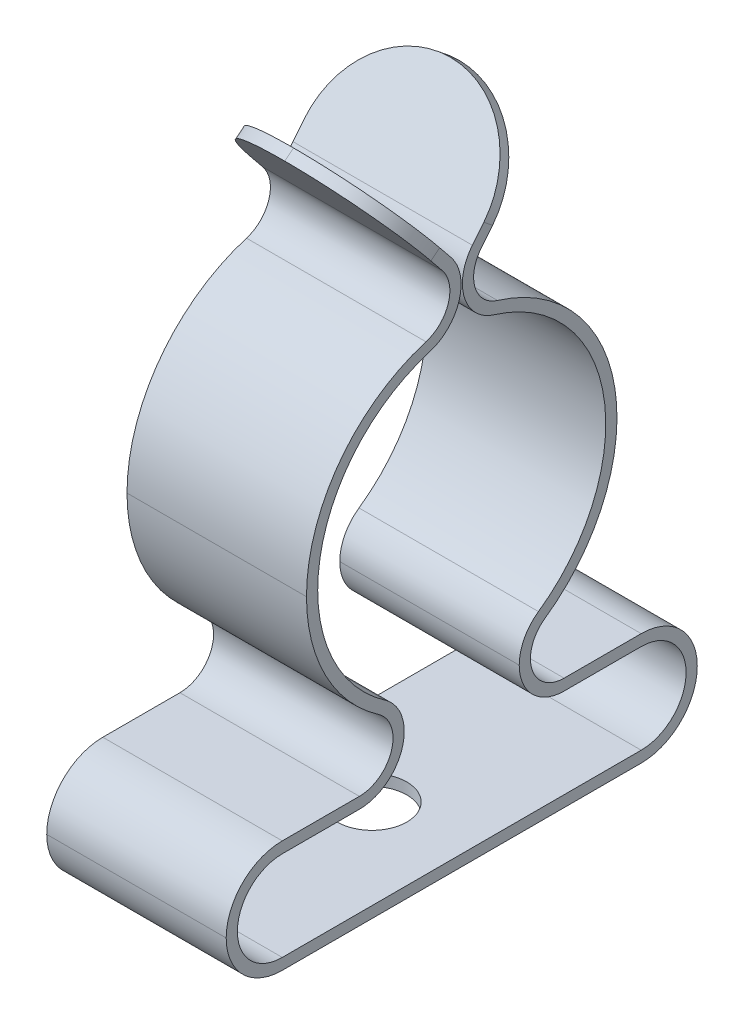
ISO-10303-21;
HEADER;
FILE_DESCRIPTION(('STEP AP214'),'2;1');
FILE_NAME('part.step','',(''),(''),'','','');
FILE_SCHEMA(('AUTOMOTIVE_DESIGN { 1 0 10303 214 1 1 1 1 }'));
ENDSEC;
DATA;
#1=APPLICATION_CONTEXT('core data for automotive mechanical design processes');
#2=APPLICATION_PROTOCOL_DEFINITION('international standard','automotive_design',2000,#1);
#3=PRODUCT_CONTEXT('',#1,'mechanical');
#4=PRODUCT('Part','Part','',(#3));
#5=PRODUCT_RELATED_PRODUCT_CATEGORY('part','',(#4));
#6=PRODUCT_DEFINITION_FORMATION('','',#4);
#7=PRODUCT_DEFINITION_CONTEXT('part definition',#1,'design');
#8=PRODUCT_DEFINITION('design','',#6,#7);
#9=PRODUCT_DEFINITION_SHAPE('','',#8);
#10=(LENGTH_UNIT() NAMED_UNIT(*) SI_UNIT(.MILLI.,.METRE.));
#11=(NAMED_UNIT(*) PLANE_ANGLE_UNIT() SI_UNIT($,.RADIAN.));
#12=(NAMED_UNIT(*) SI_UNIT($,.STERADIAN.) SOLID_ANGLE_UNIT());
#13=UNCERTAINTY_MEASURE_WITH_UNIT(LENGTH_MEASURE(1.E-05),#10,'distance_accuracy_value','');
#14=(GEOMETRIC_REPRESENTATION_CONTEXT(3) GLOBAL_UNCERTAINTY_ASSIGNED_CONTEXT((#13)) GLOBAL_UNIT_ASSIGNED_CONTEXT((#10,
#11,#12)) REPRESENTATION_CONTEXT('',''));
#15=CARTESIAN_POINT('',(0.,0.,0.));
#16=DIRECTION('',(0.,0.,1.));
#17=DIRECTION('',(1.,0.,0.));
#18=AXIS2_PLACEMENT_3D('',#15,#16,#17);
#19=CARTESIAN_POINT('',(0.,32.4320461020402,4.45967637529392));
#20=DIRECTION('',(0.,-0.628730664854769,-0.77762314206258));
#21=DIRECTION('',(0.,0.777623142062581,-0.628730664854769));
#22=AXIS2_PLACEMENT_3D('',#19,#20,#21);
#23=CYLINDRICAL_SURFACE('',#22,4.);
#24=CARTESIAN_POINT('',(0.,33.6895074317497,6.01492265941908));
#25=DIRECTION('',(0.,0.628730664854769,0.77762314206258));
#26=DIRECTION('',(0.,-0.77762314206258,0.628730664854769));
#27=AXIS2_PLACEMENT_3D('',#24,#25,#26);
#28=CIRCLE('',#27,4.);
#29=CARTESIAN_POINT('',(0.,36.8,3.5));
#30=VERTEX_POINT('',#29);
#31=CARTESIAN_POINT('',(-4.,33.6895074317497,6.01492265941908));
#32=VERTEX_POINT('',#31);
#33=EDGE_CURVE('E518',#30,#32,#28,.T.);
#34=ORIENTED_EDGE('',*,*,#33,.F.);
#35=DIRECTION('',(0.,-0.628730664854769,-0.777623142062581));
#36=VECTOR('',#35,1.);
#37=CARTESIAN_POINT('',(0.,36.4856346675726,3.11118842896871));
#38=LINE('',#37,#36);
#39=CARTESIAN_POINT('',(0.,36.4856346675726,3.11118842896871));
#40=VERTEX_POINT('',#39);
#41=EDGE_CURVE('E11',#30,#40,#38,.T.);
#42=ORIENTED_EDGE('',*,*,#41,.T.);
#43=CARTESIAN_POINT('',(0.,33.3751420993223,5.62611108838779));
#44=DIRECTION('',(0.,-0.628730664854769,-0.77762314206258));
#45=DIRECTION('',(0.,-0.77762314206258,0.628730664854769));
#46=AXIS2_PLACEMENT_3D('',#43,#44,#45);
#47=CIRCLE('',#46,4.);
#48=CARTESIAN_POINT('',(-4.,33.3751420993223,5.62611108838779));
#49=VERTEX_POINT('',#48);
#50=EDGE_CURVE('E493',#49,#40,#47,.T.);
#51=ORIENTED_EDGE('',*,*,#50,.F.);
#52=DIRECTION('',(0.,-0.628730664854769,-0.777623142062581));
#53=VECTOR('',#52,1.);
#54=CARTESIAN_POINT('',(-4.,32.4320461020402,4.45967637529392));
#55=LINE('',#54,#53);
#56=EDGE_CURVE('E281',#32,#49,#55,.T.);
#57=ORIENTED_EDGE('',*,*,#56,.F.);
#58=EDGE_LOOP('',(#34,#42,#51,#57));
#59=FACE_BOUND('',#58,.T.);
#60=ADVANCED_FACE('F16',(#59),#23,.T.);
#61=CARTESIAN_POINT('',(0.,33.6895074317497,6.01492265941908));
#62=DIRECTION('',(0.,0.628730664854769,0.77762314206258));
#63=DIRECTION('',(0.,-0.777623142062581,0.628730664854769));
#64=AXIS2_PLACEMENT_3D('',#61,#62,#63);
#65=CYLINDRICAL_SURFACE('',#64,4.);
#66=ORIENTED_EDGE('',*,*,#41,.F.);
#67=CARTESIAN_POINT('',(0.,33.6895074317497,6.01492265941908));
#68=DIRECTION('',(0.,0.628730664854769,0.77762314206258));
#69=DIRECTION('',(0.,-0.77762314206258,0.628730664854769));
#70=AXIS2_PLACEMENT_3D('',#67,#68,#69);
#71=CIRCLE('',#70,4.);
#72=CARTESIAN_POINT('',(4.,33.6895074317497,6.01492265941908));
#73=VERTEX_POINT('',#72);
#74=EDGE_CURVE('E511',#73,#30,#71,.T.);
#75=ORIENTED_EDGE('',*,*,#74,.F.);
#76=DIRECTION('',(0.,0.628730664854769,0.777623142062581));
#77=VECTOR('',#76,1.);
#78=CARTESIAN_POINT('',(4.,33.6895074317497,6.01492265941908));
#79=LINE('',#78,#77);
#80=CARTESIAN_POINT('',(4.,33.3751420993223,5.62611108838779));
#81=VERTEX_POINT('',#80);
#82=EDGE_CURVE('E275',#81,#73,#79,.T.);
#83=ORIENTED_EDGE('',*,*,#82,.F.);
#84=CARTESIAN_POINT('',(0.,33.3751420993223,5.62611108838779));
#85=DIRECTION('',(0.,-0.628730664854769,-0.77762314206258));
#86=DIRECTION('',(0.,-0.77762314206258,0.628730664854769));
#87=AXIS2_PLACEMENT_3D('',#84,#85,#86);
#88=CIRCLE('',#87,4.);
#89=EDGE_CURVE('E502',#40,#81,#88,.T.);
#90=ORIENTED_EDGE('',*,*,#89,.F.);
#91=EDGE_LOOP('',(#66,#75,#83,#90));
#92=FACE_BOUND('',#91,.T.);
#93=ADVANCED_FACE('F18',(#92),#65,.T.);
#94=CARTESIAN_POINT('',(0.,34.4163548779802,7.08610195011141));
#95=DIRECTION('',(0.,0.628730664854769,-0.77762314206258));
#96=DIRECTION('',(0.,0.777623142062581,0.628730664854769));
#97=AXIS2_PLACEMENT_3D('',#94,#95,#96);
#98=CYLINDRICAL_SURFACE('',#97,4.);
#99=CARTESIAN_POINT('',(0.,33.3751420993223,8.37388891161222));
#100=DIRECTION('',(0.,-0.628730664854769,0.77762314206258));
#101=DIRECTION('',(0.,0.77762314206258,0.628730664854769));
#102=AXIS2_PLACEMENT_3D('',#99,#100,#101);
#103=CIRCLE('',#102,4.);
#104=CARTESIAN_POINT('',(0.,36.4856346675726,10.8888115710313));
#105=VERTEX_POINT('',#104);
#106=CARTESIAN_POINT('',(-4.,33.3751420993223,8.37388891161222));
#107=VERTEX_POINT('',#106);
#108=EDGE_CURVE('E372',#105,#107,#103,.T.);
#109=ORIENTED_EDGE('',*,*,#108,.F.);
#110=DIRECTION('',(0.,0.628730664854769,-0.777623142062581));
#111=VECTOR('',#110,1.);
#112=CARTESIAN_POINT('',(0.,36.8,10.5));
#113=LINE('',#112,#111);
#114=CARTESIAN_POINT('',(0.,36.8,10.5));
#115=VERTEX_POINT('',#114);
#116=EDGE_CURVE('E25',#105,#115,#113,.T.);
#117=ORIENTED_EDGE('',*,*,#116,.T.);
#118=CARTESIAN_POINT('',(0.,33.6895074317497,7.98507734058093));
#119=DIRECTION('',(0.,0.628730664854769,-0.77762314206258));
#120=DIRECTION('',(0.,0.77762314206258,0.628730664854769));
#121=AXIS2_PLACEMENT_3D('',#118,#119,#120);
#122=CIRCLE('',#121,4.);
#123=CARTESIAN_POINT('',(-4.,33.6895074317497,7.98507734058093));
#124=VERTEX_POINT('',#123);
#125=EDGE_CURVE('E438',#124,#115,#122,.T.);
#126=ORIENTED_EDGE('',*,*,#125,.F.);
#127=DIRECTION('',(0.,0.628730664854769,-0.777623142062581));
#128=VECTOR('',#127,1.);
#129=CARTESIAN_POINT('',(-4.,34.4163548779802,7.08610195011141));
#130=LINE('',#129,#128);
#131=EDGE_CURVE('E279',#107,#124,#130,.T.);
#132=ORIENTED_EDGE('',*,*,#131,.F.);
#133=EDGE_LOOP('',(#109,#117,#126,#132));
#134=FACE_BOUND('',#133,.T.);
#135=ADVANCED_FACE('F881',(#134),#98,.T.);
#136=CARTESIAN_POINT('',(0.,33.3751420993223,8.37388891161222));
#137=DIRECTION('',(0.,-0.628730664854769,0.77762314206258));
#138=DIRECTION('',(0.,-0.777623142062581,-0.628730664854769));
#139=AXIS2_PLACEMENT_3D('',#136,#137,#138);
#140=CYLINDRICAL_SURFACE('',#139,4.);
#141=ORIENTED_EDGE('',*,*,#116,.F.);
#142=CARTESIAN_POINT('',(0.,33.3751420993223,8.37388891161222));
#143=DIRECTION('',(0.,-0.628730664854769,0.77762314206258));
#144=DIRECTION('',(0.,0.77762314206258,0.628730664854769));
#145=AXIS2_PLACEMENT_3D('',#142,#143,#144);
#146=CIRCLE('',#145,4.);
#147=CARTESIAN_POINT('',(4.,33.3751420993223,8.37388891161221));
#148=VERTEX_POINT('',#147);
#149=EDGE_CURVE('E368',#148,#105,#146,.T.);
#150=ORIENTED_EDGE('',*,*,#149,.F.);
#151=DIRECTION('',(0.,-0.628730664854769,0.777623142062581));
#152=VECTOR('',#151,1.);
#153=CARTESIAN_POINT('',(4.,33.3751420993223,8.37388891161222));
#154=LINE('',#153,#152);
#155=CARTESIAN_POINT('',(4.,33.6895074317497,7.98507734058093));
#156=VERTEX_POINT('',#155);
#157=EDGE_CURVE('E272',#156,#148,#154,.T.);
#158=ORIENTED_EDGE('',*,*,#157,.F.);
#159=CARTESIAN_POINT('',(0.,33.6895074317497,7.98507734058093));
#160=DIRECTION('',(0.,0.628730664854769,-0.77762314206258));
#161=DIRECTION('',(0.,0.77762314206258,0.628730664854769));
#162=AXIS2_PLACEMENT_3D('',#159,#160,#161);
#163=CIRCLE('',#162,4.);
#164=EDGE_CURVE('E442',#115,#156,#163,.T.);
#165=ORIENTED_EDGE('',*,*,#164,.F.);
#166=EDGE_LOOP('',(#141,#150,#158,#165));
#167=FACE_BOUND('',#166,.T.);
#168=ADVANCED_FACE('F891',(#167),#140,.T.);
#169=CARTESIAN_POINT('',(0.,14.1840620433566,7.));
#170=DIRECTION('',(0.,-1.,0.));
#171=DIRECTION('',(-1.,0.,0.));
#172=AXIS2_PLACEMENT_3D('',#169,#170,#171);
#173=CYLINDRICAL_SURFACE('',#172,1.55);
#174=DIRECTION('',(0.,-1.,0.));
#175=VECTOR('',#174,1.);
#176=CARTESIAN_POINT('',(1.55000000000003,14.1840620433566,7.));
#177=LINE('',#176,#175);
#178=CARTESIAN_POINT('',(1.55000000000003,9.8,7.));
#179=VERTEX_POINT('',#178);
#180=CARTESIAN_POINT('',(1.55000000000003,9.3,7.));
#181=VERTEX_POINT('',#180);
#182=EDGE_CURVE('E766',#179,#181,#177,.T.);
#183=ORIENTED_EDGE('',*,*,#182,.F.);
#184=CARTESIAN_POINT('',(0.,9.8,7.));
#185=DIRECTION('',(0.,-1.,0.));
#186=DIRECTION('',(1.,0.,0.));
#187=AXIS2_PLACEMENT_3D('',#184,#185,#186);
#188=CIRCLE('',#187,1.55);
#189=CARTESIAN_POINT('',(-1.54999999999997,9.8,7.));
#190=VERTEX_POINT('',#189);
#191=EDGE_CURVE('E307',#190,#179,#188,.T.);
#192=ORIENTED_EDGE('',*,*,#191,.F.);
#193=DIRECTION('',(0.,-1.,0.));
#194=VECTOR('',#193,1.);
#195=CARTESIAN_POINT('',(-1.54999999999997,14.1840620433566,7.));
#196=LINE('',#195,#194);
#197=CARTESIAN_POINT('',(-1.54999999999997,9.3,7.));
#198=VERTEX_POINT('',#197);
#199=EDGE_CURVE('E301',#190,#198,#196,.T.);
#200=ORIENTED_EDGE('',*,*,#199,.T.);
#201=CARTESIAN_POINT('',(0.,9.3,7.));
#202=DIRECTION('',(0.,-1.,0.));
#203=DIRECTION('',(-1.,0.,0.));
#204=AXIS2_PLACEMENT_3D('',#201,#202,#203);
#205=CIRCLE('',#204,1.55);
#206=EDGE_CURVE('E659',#198,#181,#205,.T.);
#207=ORIENTED_EDGE('',*,*,#206,.T.);
#208=EDGE_LOOP('',(#183,#192,#200,#207));
#209=FACE_BOUND('',#208,.T.);
#210=ADVANCED_FACE('F899',(#209),#173,.F.);
#211=CARTESIAN_POINT('',(-4.,31.8,4.97070381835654));
#212=DIRECTION('',(-1.,0.,0.));
#213=DIRECTION('',(0.,-1.,0.));
#214=AXIS2_PLACEMENT_3D('',#211,#212,#213);
#215=PLANE('',#214);
#216=DIRECTION('',(0.,-0.77762314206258,-0.62873066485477));
#217=VECTOR('',#216,1.);
#218=CARTESIAN_POINT('',(-4.,32.7430959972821,7.86286146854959));
#219=LINE('',#218,#217);
#220=CARTESIAN_POINT('',(-4.,32.7430959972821,7.86286146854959));
#221=VERTEX_POINT('',#220);
#222=EDGE_CURVE('E613',#107,#221,#219,.T.);
#223=ORIENTED_EDGE('',*,*,#222,.F.);
#224=ORIENTED_EDGE('',*,*,#131,.T.);
#225=DIRECTION('',(0.,-0.77762314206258,-0.628730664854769));
#226=VECTOR('',#225,1.);
#227=CARTESIAN_POINT('',(-4.,33.0574613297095,7.4740498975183));
#228=LINE('',#227,#226);
#229=CARTESIAN_POINT('',(-4.,33.0574613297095,7.4740498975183));
#230=VERTEX_POINT('',#229);
#231=EDGE_CURVE('E443',#124,#230,#228,.T.);
#232=ORIENTED_EDGE('',*,*,#231,.T.);
#233=CARTESIAN_POINT('',(-4.,31.8,9.02929618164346));
#234=DIRECTION('',(-1.,0.,0.));
#235=DIRECTION('',(0.,0.,-1.));
#236=AXIS2_PLACEMENT_3D('',#233,#234,#235);
#237=CIRCLE('',#236,2.);
#238=CARTESIAN_POINT('',(-4.,29.88586463,8.44956711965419));
#239=VERTEX_POINT('',#238);
#240=EDGE_CURVE('E597',#230,#239,#237,.T.);
#241=ORIENTED_EDGE('',*,*,#240,.T.);
#242=CARTESIAN_POINT('',(-4.,23.186390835,6.42051540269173));
#243=DIRECTION('',(1.,0.,0.));
#244=DIRECTION('',(0.,0.,1.));
#245=AXIS2_PLACEMENT_3D('',#242,#243,#244);
#246=CIRCLE('',#245,7.);
#247=CARTESIAN_POINT('',(-4.,23.186390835,13.4205154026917));
#248=VERTEX_POINT('',#247);
#249=EDGE_CURVE('E413',#239,#248,#246,.T.);
#250=ORIENTED_EDGE('',*,*,#249,.T.);
#251=CARTESIAN_POINT('',(-4.,23.186390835,6.42051540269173));
#252=DIRECTION('',(1.,0.,0.));
#253=DIRECTION('',(0.,0.,1.));
#254=AXIS2_PLACEMENT_3D('',#251,#252,#253);
#255=CIRCLE('',#254,7.);
#256=CARTESIAN_POINT('',(-4.,17.4414201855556,10.419929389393));
#257=VERTEX_POINT('',#256);
#258=EDGE_CURVE('E514',#248,#257,#255,.T.);
#259=ORIENTED_EDGE('',*,*,#258,.T.);
#260=CARTESIAN_POINT('',(-4.,15.8,11.5626190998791));
#261=DIRECTION('',(-1.,0.,0.));
#262=DIRECTION('',(0.,0.,-1.));
#263=AXIS2_PLACEMENT_3D('',#260,#261,#262);
#264=CIRCLE('',#263,2.);
#265=CARTESIAN_POINT('',(-4.,13.8,11.5626190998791));
#266=VERTEX_POINT('',#265);
#267=EDGE_CURVE('E494',#257,#266,#264,.T.);
#268=ORIENTED_EDGE('',*,*,#267,.T.);
#269=DIRECTION('',(0.,0.,1.));
#270=VECTOR('',#269,1.);
#271=CARTESIAN_POINT('',(-4.,13.8,15.));
#272=LINE('',#271,#270);
#273=CARTESIAN_POINT('',(-4.,13.8,15.));
#274=VERTEX_POINT('',#273);
#275=EDGE_CURVE('E337',#266,#274,#272,.T.);
#276=ORIENTED_EDGE('',*,*,#275,.T.);
#277=CARTESIAN_POINT('',(-4.,11.8,15.));
#278=DIRECTION('',(1.,0.,0.));
#279=DIRECTION('',(0.,0.,1.));
#280=AXIS2_PLACEMENT_3D('',#277,#278,#279);
#281=CIRCLE('',#280,2.);
#282=CARTESIAN_POINT('',(-4.,11.8,17.));
#283=VERTEX_POINT('',#282);
#284=EDGE_CURVE('E435',#274,#283,#281,.T.);
#285=ORIENTED_EDGE('',*,*,#284,.T.);
#286=CARTESIAN_POINT('',(-4.,11.8,15.));
#287=DIRECTION('',(1.,0.,0.));
#288=DIRECTION('',(0.,0.,1.));
#289=AXIS2_PLACEMENT_3D('',#286,#287,#288);
#290=CIRCLE('',#289,2.);
#291=CARTESIAN_POINT('',(-4.,9.8,15.));
#292=VERTEX_POINT('',#291);
#293=EDGE_CURVE('E306',#283,#292,#290,.T.);
#294=ORIENTED_EDGE('',*,*,#293,.T.);
#295=DIRECTION('',(0.,0.,-1.));
#296=VECTOR('',#295,1.);
#297=CARTESIAN_POINT('',(-4.,9.8,15.));
#298=LINE('',#297,#296);
#299=CARTESIAN_POINT('',(-4.,9.8,-1.));
#300=VERTEX_POINT('',#299);
#301=EDGE_CURVE('E573',#292,#300,#298,.T.);
#302=ORIENTED_EDGE('',*,*,#301,.T.);
#303=CARTESIAN_POINT('',(-4.,11.8,-1.));
#304=DIRECTION('',(1.,0.,0.));
#305=DIRECTION('',(0.,0.,-1.));
#306=AXIS2_PLACEMENT_3D('',#303,#304,#305);
#307=CIRCLE('',#306,2.);
#308=CARTESIAN_POINT('',(-4.,13.8,-1.));
#309=VERTEX_POINT('',#308);
#310=EDGE_CURVE('E563',#300,#309,#307,.T.);
#311=ORIENTED_EDGE('',*,*,#310,.T.);
#312=DIRECTION('',(0.,0.,1.));
#313=VECTOR('',#312,1.);
#314=CARTESIAN_POINT('',(-4.,13.8,-1.));
#315=LINE('',#314,#313);
#316=CARTESIAN_POINT('',(-4.,13.8,2.43738090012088));
#317=VERTEX_POINT('',#316);
#318=EDGE_CURVE('E552',#309,#317,#315,.T.);
#319=ORIENTED_EDGE('',*,*,#318,.T.);
#320=CARTESIAN_POINT('',(-4.,15.8,2.43738090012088));
#321=DIRECTION('',(-1.,0.,0.));
#322=DIRECTION('',(0.,0.,1.));
#323=AXIS2_PLACEMENT_3D('',#320,#321,#322);
#324=CIRCLE('',#323,2.);
#325=CARTESIAN_POINT('',(-4.,15.8,4.43738090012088));
#326=VERTEX_POINT('',#325);
#327=EDGE_CURVE('E456',#317,#326,#324,.T.);
#328=ORIENTED_EDGE('',*,*,#327,.T.);
#329=CARTESIAN_POINT('',(-4.,15.8,2.43738090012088));
#330=DIRECTION('',(-1.,0.,0.));
#331=DIRECTION('',(0.,0.,1.));
#332=AXIS2_PLACEMENT_3D('',#329,#330,#331);
#333=CIRCLE('',#332,2.);
#334=CARTESIAN_POINT('',(-4.,17.4414201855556,3.58007061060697));
#335=VERTEX_POINT('',#334);
#336=EDGE_CURVE('E548',#326,#335,#333,.T.);
#337=ORIENTED_EDGE('',*,*,#336,.T.);
#338=CARTESIAN_POINT('',(-4.,23.186390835,7.57948459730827));
#339=DIRECTION('',(1.,0.,0.));
#340=DIRECTION('',(0.,0.,-1.));
#341=AXIS2_PLACEMENT_3D('',#338,#339,#340);
#342=CIRCLE('',#341,7.);
#343=CARTESIAN_POINT('',(-4.,29.88586463,5.55043288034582));
#344=VERTEX_POINT('',#343);
#345=EDGE_CURVE('E382',#335,#344,#342,.T.);
#346=ORIENTED_EDGE('',*,*,#345,.T.);
#347=CARTESIAN_POINT('',(-4.,31.8,4.97070381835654));
#348=DIRECTION('',(-1.,0.,0.));
#349=DIRECTION('',(0.,0.,1.));
#350=AXIS2_PLACEMENT_3D('',#347,#348,#349);
#351=CIRCLE('',#350,2.);
#352=CARTESIAN_POINT('',(-4.,31.8,6.97070381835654));
#353=VERTEX_POINT('',#352);
#354=EDGE_CURVE('E468',#344,#353,#351,.T.);
#355=ORIENTED_EDGE('',*,*,#354,.T.);
#356=CARTESIAN_POINT('',(-4.,31.8,4.97070381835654));
#357=DIRECTION('',(-1.,0.,0.));
#358=DIRECTION('',(0.,0.,1.));
#359=AXIS2_PLACEMENT_3D('',#356,#357,#358);
#360=CIRCLE('',#359,2.);
#361=CARTESIAN_POINT('',(-4.,33.0574613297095,6.5259501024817));
#362=VERTEX_POINT('',#361);
#363=EDGE_CURVE('E387',#353,#362,#360,.T.);
#364=ORIENTED_EDGE('',*,*,#363,.T.);
#365=DIRECTION('',(0.,0.77762314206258,-0.628730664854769));
#366=VECTOR('',#365,1.);
#367=CARTESIAN_POINT('',(-4.,33.0574613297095,6.5259501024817));
#368=LINE('',#367,#366);
#369=EDGE_CURVE('E522',#362,#32,#368,.T.);
#370=ORIENTED_EDGE('',*,*,#369,.T.);
#371=ORIENTED_EDGE('',*,*,#56,.T.);
#372=DIRECTION('',(0.,0.77762314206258,-0.62873066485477));
#373=VECTOR('',#372,1.);
#374=CARTESIAN_POINT('',(-4.,32.7430959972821,6.13713853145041));
#375=LINE('',#374,#373);
#376=CARTESIAN_POINT('',(-4.,32.7430959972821,6.13713853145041));
#377=VERTEX_POINT('',#376);
#378=EDGE_CURVE('E489',#377,#49,#375,.T.);
#379=ORIENTED_EDGE('',*,*,#378,.F.);
#380=CARTESIAN_POINT('',(-4.,31.8,4.97070381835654));
#381=DIRECTION('',(-1.,0.,0.));
#382=DIRECTION('',(0.,0.,-1.));
#383=AXIS2_PLACEMENT_3D('',#380,#381,#382);
#384=CIRCLE('',#383,1.5);
#385=CARTESIAN_POINT('',(-4.,31.8,6.47070381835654));
#386=VERTEX_POINT('',#385);
#387=EDGE_CURVE('E326',#386,#377,#384,.T.);
#388=ORIENTED_EDGE('',*,*,#387,.F.);
#389=CARTESIAN_POINT('',(-4.,31.8,4.97070381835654));
#390=DIRECTION('',(-1.,0.,0.));
#391=DIRECTION('',(0.,0.,-1.));
#392=AXIS2_PLACEMENT_3D('',#389,#390,#391);
#393=CIRCLE('',#392,1.5);
#394=CARTESIAN_POINT('',(-4.,30.3643984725,5.4055006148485));
#395=VERTEX_POINT('',#394);
#396=EDGE_CURVE('E49',#395,#386,#393,.T.);
#397=ORIENTED_EDGE('',*,*,#396,.F.);
#398=CARTESIAN_POINT('',(-4.,23.186390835,7.57948459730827));
#399=DIRECTION('',(1.,0.,0.));
#400=DIRECTION('',(0.,0.,-1.));
#401=AXIS2_PLACEMENT_3D('',#398,#399,#400);
#402=CIRCLE('',#401,7.5);
#403=CARTESIAN_POINT('',(-4.,17.0310651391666,3.29439818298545));
#404=VERTEX_POINT('',#403);
#405=EDGE_CURVE('E243',#404,#395,#402,.T.);
#406=ORIENTED_EDGE('',*,*,#405,.F.);
#407=CARTESIAN_POINT('',(-4.,15.8,2.43738090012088));
#408=DIRECTION('',(-1.,0.,0.));
#409=DIRECTION('',(0.,0.,-1.));
#410=AXIS2_PLACEMENT_3D('',#407,#408,#409);
#411=CIRCLE('',#410,1.5);
#412=CARTESIAN_POINT('',(-4.,15.8,3.93738090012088));
#413=VERTEX_POINT('',#412);
#414=EDGE_CURVE('E238',#413,#404,#411,.T.);
#415=ORIENTED_EDGE('',*,*,#414,.F.);
#416=CARTESIAN_POINT('',(-4.,15.8,2.43738090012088));
#417=DIRECTION('',(-1.,0.,0.));
#418=DIRECTION('',(0.,0.,-1.));
#419=AXIS2_PLACEMENT_3D('',#416,#417,#418);
#420=CIRCLE('',#419,1.5);
#421=CARTESIAN_POINT('',(-4.,14.3,2.43738090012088));
#422=VERTEX_POINT('',#421);
#423=EDGE_CURVE('E229',#422,#413,#420,.T.);
#424=ORIENTED_EDGE('',*,*,#423,.F.);
#425=DIRECTION('',(0.,0.,1.));
#426=VECTOR('',#425,1.);
#427=CARTESIAN_POINT('',(-4.,14.3,-1.));
#428=LINE('',#427,#426);
#429=CARTESIAN_POINT('',(-4.,14.3,-1.));
#430=VERTEX_POINT('',#429);
#431=EDGE_CURVE('E234',#430,#422,#428,.T.);
#432=ORIENTED_EDGE('',*,*,#431,.F.);
#433=CARTESIAN_POINT('',(-4.,11.8,-1.));
#434=DIRECTION('',(1.,0.,0.));
#435=DIRECTION('',(0.,0.,-1.));
#436=AXIS2_PLACEMENT_3D('',#433,#434,#435);
#437=CIRCLE('',#436,2.5);
#438=CARTESIAN_POINT('',(-4.,9.3,-1.));
#439=VERTEX_POINT('',#438);
#440=EDGE_CURVE('E662',#439,#430,#437,.T.);
#441=ORIENTED_EDGE('',*,*,#440,.F.);
#442=DIRECTION('',(0.,0.,-1.));
#443=VECTOR('',#442,1.);
#444=CARTESIAN_POINT('',(-4.,9.3,15.));
#445=LINE('',#444,#443);
#446=CARTESIAN_POINT('',(-4.,9.3,15.));
#447=VERTEX_POINT('',#446);
#448=EDGE_CURVE('E647',#447,#439,#445,.T.);
#449=ORIENTED_EDGE('',*,*,#448,.F.);
#450=CARTESIAN_POINT('',(-4.,11.8,15.));
#451=DIRECTION('',(1.,0.,0.));
#452=DIRECTION('',(0.,0.,-1.));
#453=AXIS2_PLACEMENT_3D('',#450,#451,#452);
#454=CIRCLE('',#453,2.5);
#455=CARTESIAN_POINT('',(-4.,11.8,17.5));
#456=VERTEX_POINT('',#455);
#457=EDGE_CURVE('E333',#456,#447,#454,.T.);
#458=ORIENTED_EDGE('',*,*,#457,.F.);
#459=CARTESIAN_POINT('',(-4.,11.8,15.));
#460=DIRECTION('',(1.,0.,0.));
#461=DIRECTION('',(0.,0.,-1.));
#462=AXIS2_PLACEMENT_3D('',#459,#460,#461);
#463=CIRCLE('',#462,2.5);
#464=CARTESIAN_POINT('',(-4.,14.3,15.));
#465=VERTEX_POINT('',#464);
#466=EDGE_CURVE('E461',#465,#456,#463,.T.);
#467=ORIENTED_EDGE('',*,*,#466,.F.);
#468=DIRECTION('',(0.,0.,1.));
#469=VECTOR('',#468,1.);
#470=CARTESIAN_POINT('',(-4.,14.3,15.));
#471=LINE('',#470,#469);
#472=CARTESIAN_POINT('',(-4.,14.3,11.5626190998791));
#473=VERTEX_POINT('',#472);
#474=EDGE_CURVE('E427',#473,#465,#471,.T.);
#475=ORIENTED_EDGE('',*,*,#474,.F.);
#476=CARTESIAN_POINT('',(-4.,15.8,11.5626190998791));
#477=DIRECTION('',(-1.,0.,0.));
#478=DIRECTION('',(0.,0.,-1.));
#479=AXIS2_PLACEMENT_3D('',#476,#477,#478);
#480=CIRCLE('',#479,1.5);
#481=CARTESIAN_POINT('',(-4.,17.0310651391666,10.7056018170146));
#482=VERTEX_POINT('',#481);
#483=EDGE_CURVE('E474',#482,#473,#480,.T.);
#484=ORIENTED_EDGE('',*,*,#483,.F.);
#485=CARTESIAN_POINT('',(-4.,23.186390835,6.42051540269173));
#486=DIRECTION('',(1.,0.,0.));
#487=DIRECTION('',(0.,0.,-1.));
#488=AXIS2_PLACEMENT_3D('',#485,#486,#487);
#489=CIRCLE('',#488,7.5);
#490=CARTESIAN_POINT('',(-4.,23.186390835,13.9205154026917));
#491=VERTEX_POINT('',#490);
#492=EDGE_CURVE('E381',#491,#482,#489,.T.);
#493=ORIENTED_EDGE('',*,*,#492,.F.);
#494=CARTESIAN_POINT('',(-4.,23.186390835,6.42051540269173));
#495=DIRECTION('',(1.,0.,0.));
#496=DIRECTION('',(0.,0.,-1.));
#497=AXIS2_PLACEMENT_3D('',#494,#495,#496);
#498=CIRCLE('',#497,7.5);
#499=CARTESIAN_POINT('',(-4.,30.3643984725,8.59449938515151));
#500=VERTEX_POINT('',#499);
#501=EDGE_CURVE('E637',#500,#491,#498,.T.);
#502=ORIENTED_EDGE('',*,*,#501,.F.);
#503=CARTESIAN_POINT('',(-4.,31.8,9.02929618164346));
#504=DIRECTION('',(-1.,0.,0.));
#505=DIRECTION('',(0.,0.,-1.));
#506=AXIS2_PLACEMENT_3D('',#503,#504,#505);
#507=CIRCLE('',#506,1.5);
#508=EDGE_CURVE('E408',#221,#500,#507,.T.);
#509=ORIENTED_EDGE('',*,*,#508,.F.);
#510=EDGE_LOOP('',(#223,#224,#232,#241,#250,#259,#268,#276,#285,#294,#302,#311,#319,#328,#337,
#346,#355,#364,#370,#371,#379,#388,#397,#406,#415,#424,#432,#441,#449,#458,#467,#475,#484,#493,
#502,#509));
#511=FACE_BOUND('',#510,.T.);
#512=ADVANCED_FACE('F232',(#511),#215,.T.);
#513=CARTESIAN_POINT('',(4.,31.8,4.97070381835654));
#514=DIRECTION('',(-1.,0.,0.));
#515=DIRECTION('',(0.,-1.,0.));
#516=AXIS2_PLACEMENT_3D('',#513,#514,#515);
#517=PLANE('',#516);
#518=DIRECTION('',(0.,-0.77762314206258,-0.628730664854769));
#519=VECTOR('',#518,1.);
#520=CARTESIAN_POINT('',(4.,33.0574613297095,7.4740498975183));
#521=LINE('',#520,#519);
#522=CARTESIAN_POINT('',(4.,33.0574613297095,7.4740498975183));
#523=VERTEX_POINT('',#522);
#524=EDGE_CURVE('E373',#156,#523,#521,.T.);
#525=ORIENTED_EDGE('',*,*,#524,.F.);
#526=ORIENTED_EDGE('',*,*,#157,.T.);
#527=DIRECTION('',(0.,-0.77762314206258,-0.62873066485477));
#528=VECTOR('',#527,1.);
#529=CARTESIAN_POINT('',(4.,32.7430959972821,7.86286146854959));
#530=LINE('',#529,#528);
#531=CARTESIAN_POINT('',(4.,32.7430959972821,7.86286146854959));
#532=VERTEX_POINT('',#531);
#533=EDGE_CURVE('E404',#148,#532,#530,.T.);
#534=ORIENTED_EDGE('',*,*,#533,.T.);
#535=CARTESIAN_POINT('',(4.,31.8,9.02929618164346));
#536=DIRECTION('',(-1.,0.,0.));
#537=DIRECTION('',(0.,0.,-1.));
#538=AXIS2_PLACEMENT_3D('',#535,#536,#537);
#539=CIRCLE('',#538,1.5);
#540=CARTESIAN_POINT('',(4.,30.3643984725,8.59449938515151));
#541=VERTEX_POINT('',#540);
#542=EDGE_CURVE('E629',#532,#541,#539,.T.);
#543=ORIENTED_EDGE('',*,*,#542,.T.);
#544=CARTESIAN_POINT('',(4.,23.186390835,6.42051540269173));
#545=DIRECTION('',(1.,0.,0.));
#546=DIRECTION('',(0.,0.,-1.));
#547=AXIS2_PLACEMENT_3D('',#544,#545,#546);
#548=CIRCLE('',#547,7.5);
#549=CARTESIAN_POINT('',(4.,23.186390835,13.9205154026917));
#550=VERTEX_POINT('',#549);
#551=EDGE_CURVE('E633',#541,#550,#548,.T.);
#552=ORIENTED_EDGE('',*,*,#551,.T.);
#553=CARTESIAN_POINT('',(4.,23.186390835,6.42051540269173));
#554=DIRECTION('',(1.,0.,0.));
#555=DIRECTION('',(0.,0.,-1.));
#556=AXIS2_PLACEMENT_3D('',#553,#554,#555);
#557=CIRCLE('',#556,7.5);
#558=CARTESIAN_POINT('',(4.,17.0310651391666,10.7056018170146));
#559=VERTEX_POINT('',#558);
#560=EDGE_CURVE('E364',#550,#559,#557,.T.);
#561=ORIENTED_EDGE('',*,*,#560,.T.);
#562=CARTESIAN_POINT('',(4.,15.8,11.5626190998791));
#563=DIRECTION('',(-1.,0.,0.));
#564=DIRECTION('',(0.,0.,-1.));
#565=AXIS2_PLACEMENT_3D('',#562,#563,#564);
#566=CIRCLE('',#565,1.5);
#567=CARTESIAN_POINT('',(4.,14.3,11.5626190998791));
#568=VERTEX_POINT('',#567);
#569=EDGE_CURVE('E473',#559,#568,#566,.T.);
#570=ORIENTED_EDGE('',*,*,#569,.T.);
#571=DIRECTION('',(0.,0.,1.));
#572=VECTOR('',#571,1.);
#573=CARTESIAN_POINT('',(4.,14.3,15.));
#574=LINE('',#573,#572);
#575=CARTESIAN_POINT('',(4.,14.3,15.));
#576=VERTEX_POINT('',#575);
#577=EDGE_CURVE('E426',#568,#576,#574,.T.);
#578=ORIENTED_EDGE('',*,*,#577,.T.);
#579=CARTESIAN_POINT('',(4.,11.8,15.));
#580=DIRECTION('',(1.,0.,0.));
#581=DIRECTION('',(0.,0.,-1.));
#582=AXIS2_PLACEMENT_3D('',#579,#580,#581);
#583=CIRCLE('',#582,2.5);
#584=CARTESIAN_POINT('',(4.,11.8,17.5));
#585=VERTEX_POINT('',#584);
#586=EDGE_CURVE('E457',#576,#585,#583,.T.);
#587=ORIENTED_EDGE('',*,*,#586,.T.);
#588=CARTESIAN_POINT('',(4.,11.8,15.));
#589=DIRECTION('',(1.,0.,0.));
#590=DIRECTION('',(0.,0.,-1.));
#591=AXIS2_PLACEMENT_3D('',#588,#589,#590);
#592=CIRCLE('',#591,2.5);
#593=CARTESIAN_POINT('',(4.,9.3,15.));
#594=VERTEX_POINT('',#593);
#595=EDGE_CURVE('E334',#585,#594,#592,.T.);
#596=ORIENTED_EDGE('',*,*,#595,.T.);
#597=DIRECTION('',(0.,0.,-1.));
#598=VECTOR('',#597,1.);
#599=CARTESIAN_POINT('',(4.,9.3,15.));
#600=LINE('',#599,#598);
#601=CARTESIAN_POINT('',(4.,9.3,-1.));
#602=VERTEX_POINT('',#601);
#603=EDGE_CURVE('E655',#594,#602,#600,.T.);
#604=ORIENTED_EDGE('',*,*,#603,.T.);
#605=CARTESIAN_POINT('',(4.,11.8,-1.));
#606=DIRECTION('',(1.,0.,0.));
#607=DIRECTION('',(0.,0.,-1.));
#608=AXIS2_PLACEMENT_3D('',#605,#606,#607);
#609=CIRCLE('',#608,2.5);
#610=CARTESIAN_POINT('',(4.,14.3,-1.));
#611=VERTEX_POINT('',#610);
#612=EDGE_CURVE('E260',#602,#611,#609,.T.);
#613=ORIENTED_EDGE('',*,*,#612,.T.);
#614=DIRECTION('',(0.,0.,1.));
#615=VECTOR('',#614,1.);
#616=CARTESIAN_POINT('',(4.,14.3,-1.));
#617=LINE('',#616,#615);
#618=CARTESIAN_POINT('',(4.,14.3,2.43738090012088));
#619=VERTEX_POINT('',#618);
#620=EDGE_CURVE('E253',#611,#619,#617,.T.);
#621=ORIENTED_EDGE('',*,*,#620,.T.);
#622=CARTESIAN_POINT('',(4.,15.8,2.43738090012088));
#623=DIRECTION('',(-1.,0.,0.));
#624=DIRECTION('',(0.,0.,-1.));
#625=AXIS2_PLACEMENT_3D('',#622,#623,#624);
#626=CIRCLE('',#625,1.5);
#627=CARTESIAN_POINT('',(4.,15.8,3.93738090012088));
#628=VERTEX_POINT('',#627);
#629=EDGE_CURVE('E244',#619,#628,#626,.T.);
#630=ORIENTED_EDGE('',*,*,#629,.T.);
#631=CARTESIAN_POINT('',(4.,15.8,2.43738090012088));
#632=DIRECTION('',(-1.,0.,0.));
#633=DIRECTION('',(0.,0.,-1.));
#634=AXIS2_PLACEMENT_3D('',#631,#632,#633);
#635=CIRCLE('',#634,1.5);
#636=CARTESIAN_POINT('',(4.,17.0310651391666,3.29439818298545));
#637=VERTEX_POINT('',#636);
#638=EDGE_CURVE('E345',#628,#637,#635,.T.);
#639=ORIENTED_EDGE('',*,*,#638,.T.);
#640=CARTESIAN_POINT('',(4.,23.186390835,7.57948459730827));
#641=DIRECTION('',(1.,0.,0.));
#642=DIRECTION('',(0.,0.,-1.));
#643=AXIS2_PLACEMENT_3D('',#640,#641,#642);
#644=CIRCLE('',#643,7.5);
#645=CARTESIAN_POINT('',(4.,30.3643984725,5.4055006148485));
#646=VERTEX_POINT('',#645);
#647=EDGE_CURVE('E313',#637,#646,#644,.T.);
#648=ORIENTED_EDGE('',*,*,#647,.T.);
#649=CARTESIAN_POINT('',(4.,31.8,4.97070381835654));
#650=DIRECTION('',(-1.,0.,0.));
#651=DIRECTION('',(0.,0.,-1.));
#652=AXIS2_PLACEMENT_3D('',#649,#650,#651);
#653=CIRCLE('',#652,1.5);
#654=CARTESIAN_POINT('',(4.,31.8,6.47070381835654));
#655=VERTEX_POINT('',#654);
#656=EDGE_CURVE('E36',#646,#655,#653,.T.);
#657=ORIENTED_EDGE('',*,*,#656,.T.);
#658=CARTESIAN_POINT('',(4.,31.8,4.97070381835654));
#659=DIRECTION('',(-1.,0.,0.));
#660=DIRECTION('',(0.,0.,-1.));
#661=AXIS2_PLACEMENT_3D('',#658,#659,#660);
#662=CIRCLE('',#661,1.5);
#663=CARTESIAN_POINT('',(4.,32.7430959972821,6.13713853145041));
#664=VERTEX_POINT('',#663);
#665=EDGE_CURVE('E308',#655,#664,#662,.T.);
#666=ORIENTED_EDGE('',*,*,#665,.T.);
#667=DIRECTION('',(0.,0.77762314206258,-0.62873066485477));
#668=VECTOR('',#667,1.);
#669=CARTESIAN_POINT('',(4.,32.7430959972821,6.13713853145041));
#670=LINE('',#669,#668);
#671=EDGE_CURVE('E507',#664,#81,#670,.T.);
#672=ORIENTED_EDGE('',*,*,#671,.T.);
#673=ORIENTED_EDGE('',*,*,#82,.T.);
#674=DIRECTION('',(0.,0.77762314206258,-0.628730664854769));
#675=VECTOR('',#674,1.);
#676=CARTESIAN_POINT('',(4.,33.0574613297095,6.5259501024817));
#677=LINE('',#676,#675);
#678=CARTESIAN_POINT('',(4.,33.0574613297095,6.5259501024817));
#679=VERTEX_POINT('',#678);
#680=EDGE_CURVE('E531',#679,#73,#677,.T.);
#681=ORIENTED_EDGE('',*,*,#680,.F.);
#682=CARTESIAN_POINT('',(4.,31.8,4.97070381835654));
#683=DIRECTION('',(-1.,0.,0.));
#684=DIRECTION('',(0.,0.,1.));
#685=AXIS2_PLACEMENT_3D('',#682,#683,#684);
#686=CIRCLE('',#685,2.);
#687=CARTESIAN_POINT('',(4.,31.8,6.97070381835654));
#688=VERTEX_POINT('',#687);
#689=EDGE_CURVE('E535',#688,#679,#686,.T.);
#690=ORIENTED_EDGE('',*,*,#689,.F.);
#691=CARTESIAN_POINT('',(4.,31.8,4.97070381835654));
#692=DIRECTION('',(-1.,0.,0.));
#693=DIRECTION('',(0.,0.,1.));
#694=AXIS2_PLACEMENT_3D('',#691,#692,#693);
#695=CIRCLE('',#694,2.);
#696=CARTESIAN_POINT('',(4.,29.88586463,5.55043288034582));
#697=VERTEX_POINT('',#696);
#698=EDGE_CURVE('E317',#697,#688,#695,.T.);
#699=ORIENTED_EDGE('',*,*,#698,.F.);
#700=CARTESIAN_POINT('',(4.,23.186390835,7.57948459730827));
#701=DIRECTION('',(1.,0.,0.));
#702=DIRECTION('',(0.,0.,-1.));
#703=AXIS2_PLACEMENT_3D('',#700,#701,#702);
#704=CIRCLE('',#703,7.);
#705=CARTESIAN_POINT('',(4.,17.4414201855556,3.58007061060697));
#706=VERTEX_POINT('',#705);
#707=EDGE_CURVE('E395',#706,#697,#704,.T.);
#708=ORIENTED_EDGE('',*,*,#707,.F.);
#709=CARTESIAN_POINT('',(4.,15.8,2.43738090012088));
#710=DIRECTION('',(-1.,0.,0.));
#711=DIRECTION('',(0.,0.,1.));
#712=AXIS2_PLACEMENT_3D('',#709,#710,#711);
#713=CIRCLE('',#712,2.);
#714=CARTESIAN_POINT('',(4.,15.8,4.43738090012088));
#715=VERTEX_POINT('',#714);
#716=EDGE_CURVE('E545',#715,#706,#713,.T.);
#717=ORIENTED_EDGE('',*,*,#716,.F.);
#718=CARTESIAN_POINT('',(4.,15.8,2.43738090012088));
#719=DIRECTION('',(-1.,0.,0.));
#720=DIRECTION('',(0.,0.,1.));
#721=AXIS2_PLACEMENT_3D('',#718,#719,#720);
#722=CIRCLE('',#721,2.);
#723=CARTESIAN_POINT('',(4.,13.8,2.43738090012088));
#724=VERTEX_POINT('',#723);
#725=EDGE_CURVE('E451',#724,#715,#722,.T.);
#726=ORIENTED_EDGE('',*,*,#725,.F.);
#727=DIRECTION('',(0.,0.,1.));
#728=VECTOR('',#727,1.);
#729=CARTESIAN_POINT('',(4.,13.8,-1.));
#730=LINE('',#729,#728);
#731=CARTESIAN_POINT('',(4.,13.8,-1.));
#732=VERTEX_POINT('',#731);
#733=EDGE_CURVE('E559',#732,#724,#730,.T.);
#734=ORIENTED_EDGE('',*,*,#733,.F.);
#735=CARTESIAN_POINT('',(4.,11.8,-1.));
#736=DIRECTION('',(1.,0.,0.));
#737=DIRECTION('',(0.,0.,-1.));
#738=AXIS2_PLACEMENT_3D('',#735,#736,#737);
#739=CIRCLE('',#738,2.);
#740=CARTESIAN_POINT('',(4.,9.8,-1.));
#741=VERTEX_POINT('',#740);
#742=EDGE_CURVE('E570',#741,#732,#739,.T.);
#743=ORIENTED_EDGE('',*,*,#742,.F.);
#744=DIRECTION('',(0.,0.,-1.));
#745=VECTOR('',#744,1.);
#746=CARTESIAN_POINT('',(4.,9.8,15.));
#747=LINE('',#746,#745);
#748=CARTESIAN_POINT('',(4.,9.8,15.));
#749=VERTEX_POINT('',#748);
#750=EDGE_CURVE('E583',#749,#741,#747,.T.);
#751=ORIENTED_EDGE('',*,*,#750,.F.);
#752=CARTESIAN_POINT('',(4.,11.8,15.));
#753=DIRECTION('',(1.,0.,0.));
#754=DIRECTION('',(0.,0.,1.));
#755=AXIS2_PLACEMENT_3D('',#752,#753,#754);
#756=CIRCLE('',#755,2.);
#757=CARTESIAN_POINT('',(4.,11.8,17.));
#758=VERTEX_POINT('',#757);
#759=EDGE_CURVE('E303',#758,#749,#756,.T.);
#760=ORIENTED_EDGE('',*,*,#759,.F.);
#761=CARTESIAN_POINT('',(4.,11.8,15.));
#762=DIRECTION('',(1.,0.,0.));
#763=DIRECTION('',(0.,0.,1.));
#764=AXIS2_PLACEMENT_3D('',#761,#762,#763);
#765=CIRCLE('',#764,2.);
#766=CARTESIAN_POINT('',(4.,13.8,15.));
#767=VERTEX_POINT('',#766);
#768=EDGE_CURVE('E421',#767,#758,#765,.T.);
#769=ORIENTED_EDGE('',*,*,#768,.F.);
#770=DIRECTION('',(0.,0.,1.));
#771=VECTOR('',#770,1.);
#772=CARTESIAN_POINT('',(4.,13.8,15.));
#773=LINE('',#772,#771);
#774=CARTESIAN_POINT('',(4.,13.8,11.5626190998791));
#775=VERTEX_POINT('',#774);
#776=EDGE_CURVE('E485',#775,#767,#773,.T.);
#777=ORIENTED_EDGE('',*,*,#776,.F.);
#778=CARTESIAN_POINT('',(4.,15.8,11.5626190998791));
#779=DIRECTION('',(-1.,0.,0.));
#780=DIRECTION('',(0.,0.,-1.));
#781=AXIS2_PLACEMENT_3D('',#778,#779,#780);
#782=CIRCLE('',#781,2.);
#783=CARTESIAN_POINT('',(4.,17.4414201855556,10.419929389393));
#784=VERTEX_POINT('',#783);
#785=EDGE_CURVE('E503',#784,#775,#782,.T.);
#786=ORIENTED_EDGE('',*,*,#785,.F.);
#787=CARTESIAN_POINT('',(4.,23.186390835,6.42051540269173));
#788=DIRECTION('',(1.,0.,0.));
#789=DIRECTION('',(0.,0.,1.));
#790=AXIS2_PLACEMENT_3D('',#787,#788,#789);
#791=CIRCLE('',#790,7.);
#792=CARTESIAN_POINT('',(4.,23.186390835,13.4205154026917));
#793=VERTEX_POINT('',#792);
#794=EDGE_CURVE('E506',#793,#784,#791,.T.);
#795=ORIENTED_EDGE('',*,*,#794,.F.);
#796=CARTESIAN_POINT('',(4.,23.186390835,6.42051540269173));
#797=DIRECTION('',(1.,0.,0.));
#798=DIRECTION('',(0.,0.,1.));
#799=AXIS2_PLACEMENT_3D('',#796,#797,#798);
#800=CIRCLE('',#799,7.);
#801=CARTESIAN_POINT('',(4.,29.88586463,8.44956711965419));
#802=VERTEX_POINT('',#801);
#803=EDGE_CURVE('E399',#802,#793,#800,.T.);
#804=ORIENTED_EDGE('',*,*,#803,.F.);
#805=CARTESIAN_POINT('',(4.,31.8,9.02929618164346));
#806=DIRECTION('',(-1.,0.,0.));
#807=DIRECTION('',(0.,0.,-1.));
#808=AXIS2_PLACEMENT_3D('',#805,#806,#807);
#809=CIRCLE('',#808,2.);
#810=EDGE_CURVE('E542',#523,#802,#809,.T.);
#811=ORIENTED_EDGE('',*,*,#810,.F.);
#812=EDGE_LOOP('',(#525,#526,#534,#543,#552,#561,#570,#578,#587,#596,#604,#613,#621,#630,#639,
#648,#657,#666,#672,#673,#681,#690,#699,#708,#717,#726,#734,#743,#751,#760,#769,#777,#786,#795,
#804,#811));
#813=FACE_BOUND('',#812,.T.);
#814=ADVANCED_FACE('F754',(#813),#517,.F.);
#815=CARTESIAN_POINT('',(4.,31.8,4.97070381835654));
#816=DIRECTION('',(-1.,0.,0.));
#817=DIRECTION('',(0.,0.,1.));
#818=AXIS2_PLACEMENT_3D('',#815,#816,#817);
#819=CYLINDRICAL_SURFACE('',#818,1.5);
#820=DIRECTION('',(-1.,0.,0.));
#821=VECTOR('',#820,1.);
#822=CARTESIAN_POINT('',(4.,31.8,6.47070381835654));
#823=LINE('',#822,#821);
#824=EDGE_CURVE('E312',#655,#386,#823,.T.);
#825=ORIENTED_EDGE('',*,*,#824,.F.);
#826=ORIENTED_EDGE('',*,*,#656,.F.);
#827=DIRECTION('',(-1.,0.,0.));
#828=VECTOR('',#827,1.);
#829=CARTESIAN_POINT('',(4.,30.3643984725,5.4055006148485));
#830=LINE('',#829,#828);
#831=EDGE_CURVE('E316',#646,#395,#830,.T.);
#832=ORIENTED_EDGE('',*,*,#831,.T.);
#833=ORIENTED_EDGE('',*,*,#396,.T.);
#834=EDGE_LOOP('',(#825,#826,#832,#833));
#835=FACE_BOUND('',#834,.T.);
#836=ADVANCED_FACE('F857',(#835),#819,.F.);
#837=CARTESIAN_POINT('',(4.,23.186390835,7.57948459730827));
#838=DIRECTION('',(-1.,0.,0.));
#839=DIRECTION('',(0.,0.,1.));
#840=AXIS2_PLACEMENT_3D('',#837,#838,#839);
#841=CYLINDRICAL_SURFACE('',#840,7.5);
#842=ORIENTED_EDGE('',*,*,#405,.T.);
#843=ORIENTED_EDGE('',*,*,#831,.F.);
#844=ORIENTED_EDGE('',*,*,#647,.F.);
#845=DIRECTION('',(-1.,0.,0.));
#846=VECTOR('',#845,1.);
#847=CARTESIAN_POINT('',(4.,17.0310651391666,3.29439818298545));
#848=LINE('',#847,#846);
#849=EDGE_CURVE('E350',#637,#404,#848,.T.);
#850=ORIENTED_EDGE('',*,*,#849,.T.);
#851=EDGE_LOOP('',(#842,#843,#844,#850));
#852=FACE_BOUND('',#851,.T.);
#853=ADVANCED_FACE('F861',(#852),#841,.T.);
#854=CARTESIAN_POINT('',(4.,15.8,2.43738090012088));
#855=DIRECTION('',(-1.,0.,0.));
#856=DIRECTION('',(0.,0.,1.));
#857=AXIS2_PLACEMENT_3D('',#854,#855,#856);
#858=CYLINDRICAL_SURFACE('',#857,1.5);
#859=DIRECTION('',(-1.,0.,0.));
#860=VECTOR('',#859,1.);
#861=CARTESIAN_POINT('',(4.,15.8,3.93738090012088));
#862=LINE('',#861,#860);
#863=EDGE_CURVE('E349',#628,#413,#862,.T.);
#864=ORIENTED_EDGE('',*,*,#863,.F.);
#865=ORIENTED_EDGE('',*,*,#629,.F.);
#866=DIRECTION('',(-1.,0.,0.));
#867=VECTOR('',#866,1.);
#868=CARTESIAN_POINT('',(4.,14.3,2.43738090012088));
#869=LINE('',#868,#867);
#870=EDGE_CURVE('E247',#619,#422,#869,.T.);
#871=ORIENTED_EDGE('',*,*,#870,.T.);
#872=ORIENTED_EDGE('',*,*,#423,.T.);
#873=EDGE_LOOP('',(#864,#865,#871,#872));
#874=FACE_BOUND('',#873,.T.);
#875=ADVANCED_FACE('F248',(#874),#858,.F.);
#876=CARTESIAN_POINT('',(4.,14.3,-1.));
#877=DIRECTION('',(0.,-1.,0.));
#878=DIRECTION('',(-1.,0.,0.));
#879=AXIS2_PLACEMENT_3D('',#876,#877,#878);
#880=PLANE('',#879);
#881=ORIENTED_EDGE('',*,*,#431,.T.);
#882=ORIENTED_EDGE('',*,*,#870,.F.);
#883=ORIENTED_EDGE('',*,*,#620,.F.);
#884=DIRECTION('',(-1.,0.,0.));
#885=VECTOR('',#884,1.);
#886=CARTESIAN_POINT('',(4.,14.3,-1.));
#887=LINE('',#886,#885);
#888=EDGE_CURVE('E257',#611,#430,#887,.T.);
#889=ORIENTED_EDGE('',*,*,#888,.T.);
#890=EDGE_LOOP('',(#881,#882,#883,#889));
#891=FACE_BOUND('',#890,.T.);
#892=ADVANCED_FACE('F255',(#891),#880,.F.);
#893=CARTESIAN_POINT('',(4.,11.8,-1.));
#894=DIRECTION('',(-1.,0.,0.));
#895=DIRECTION('',(0.,0.,1.));
#896=AXIS2_PLACEMENT_3D('',#893,#894,#895);
#897=CYLINDRICAL_SURFACE('',#896,2.5);
#898=ORIENTED_EDGE('',*,*,#440,.T.);
#899=ORIENTED_EDGE('',*,*,#888,.F.);
#900=ORIENTED_EDGE('',*,*,#612,.F.);
#901=DIRECTION('',(-1.,0.,0.));
#902=VECTOR('',#901,1.);
#903=CARTESIAN_POINT('',(4.,9.3,-1.));
#904=LINE('',#903,#902);
#905=EDGE_CURVE('E651',#602,#439,#904,.T.);
#906=ORIENTED_EDGE('',*,*,#905,.T.);
#907=EDGE_LOOP('',(#898,#899,#900,#906));
#908=FACE_BOUND('',#907,.T.);
#909=ADVANCED_FACE('F669',(#908),#897,.T.);
#910=CARTESIAN_POINT('',(4.,9.3,15.));
#911=DIRECTION('',(0.,1.,0.));
#912=DIRECTION('',(0.,0.,-1.));
#913=AXIS2_PLACEMENT_3D('',#910,#911,#912);
#914=PLANE('',#913);
#915=ORIENTED_EDGE('',*,*,#206,.F.);
#916=CARTESIAN_POINT('',(0.,9.3,7.));
#917=DIRECTION('',(0.,-1.,0.));
#918=DIRECTION('',(-1.,0.,0.));
#919=AXIS2_PLACEMENT_3D('',#916,#917,#918);
#920=CIRCLE('',#919,1.55);
#921=EDGE_CURVE('E774',#181,#198,#920,.T.);
#922=ORIENTED_EDGE('',*,*,#921,.F.);
#923=EDGE_LOOP('',(#915,#922));
#924=FACE_BOUND('',#923,.T.);
#925=ORIENTED_EDGE('',*,*,#448,.T.);
#926=ORIENTED_EDGE('',*,*,#905,.F.);
#927=ORIENTED_EDGE('',*,*,#603,.F.);
#928=DIRECTION('',(-1.,0.,0.));
#929=VECTOR('',#928,1.);
#930=CARTESIAN_POINT('',(4.,9.3,15.));
#931=LINE('',#930,#929);
#932=EDGE_CURVE('E360',#594,#447,#931,.T.);
#933=ORIENTED_EDGE('',*,*,#932,.T.);
#934=EDGE_LOOP('',(#925,#926,#927,#933));
#935=FACE_BOUND('',#934,.T.);
#936=ADVANCED_FACE('F683',(#924,#935),#914,.F.);
#937=CARTESIAN_POINT('',(4.,11.8,15.));
#938=DIRECTION('',(-1.,0.,0.));
#939=DIRECTION('',(0.,0.,1.));
#940=AXIS2_PLACEMENT_3D('',#937,#938,#939);
#941=CYLINDRICAL_SURFACE('',#940,2.5);
#942=DIRECTION('',(-1.,0.,0.));
#943=VECTOR('',#942,1.);
#944=CARTESIAN_POINT('',(4.,11.8,17.5));
#945=LINE('',#944,#943);
#946=EDGE_CURVE('E329',#585,#456,#945,.T.);
#947=ORIENTED_EDGE('',*,*,#946,.F.);
#948=ORIENTED_EDGE('',*,*,#586,.F.);
#949=DIRECTION('',(-1.,0.,0.));
#950=VECTOR('',#949,1.);
#951=CARTESIAN_POINT('',(4.,14.3,15.));
#952=LINE('',#951,#950);
#953=EDGE_CURVE('E422',#576,#465,#952,.T.);
#954=ORIENTED_EDGE('',*,*,#953,.T.);
#955=ORIENTED_EDGE('',*,*,#466,.T.);
#956=EDGE_LOOP('',(#947,#948,#954,#955));
#957=FACE_BOUND('',#956,.T.);
#958=ADVANCED_FACE('F693',(#957),#941,.T.);
#959=CARTESIAN_POINT('',(4.,14.3,15.));
#960=DIRECTION('',(0.,-1.,0.));
#961=DIRECTION('',(-1.,0.,0.));
#962=AXIS2_PLACEMENT_3D('',#959,#960,#961);
#963=PLANE('',#962);
#964=ORIENTED_EDGE('',*,*,#474,.T.);
#965=ORIENTED_EDGE('',*,*,#953,.F.);
#966=ORIENTED_EDGE('',*,*,#577,.F.);
#967=DIRECTION('',(-1.,0.,0.));
#968=VECTOR('',#967,1.);
#969=CARTESIAN_POINT('',(4.,14.3,11.5626190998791));
#970=LINE('',#969,#968);
#971=EDGE_CURVE('E469',#568,#473,#970,.T.);
#972=ORIENTED_EDGE('',*,*,#971,.T.);
#973=EDGE_LOOP('',(#964,#965,#966,#972));
#974=FACE_BOUND('',#973,.T.);
#975=ADVANCED_FACE('F961',(#974),#963,.F.);
#976=CARTESIAN_POINT('',(4.,15.8,11.5626190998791));
#977=DIRECTION('',(-1.,0.,0.));
#978=DIRECTION('',(0.,0.,1.));
#979=AXIS2_PLACEMENT_3D('',#976,#977,#978);
#980=CYLINDRICAL_SURFACE('',#979,1.5);
#981=ORIENTED_EDGE('',*,*,#483,.T.);
#982=ORIENTED_EDGE('',*,*,#971,.F.);
#983=ORIENTED_EDGE('',*,*,#569,.F.);
#984=DIRECTION('',(-1.,0.,0.));
#985=VECTOR('',#984,1.);
#986=CARTESIAN_POINT('',(4.,17.0310651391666,10.7056018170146));
#987=LINE('',#986,#985);
#988=EDGE_CURVE('E391',#559,#482,#987,.T.);
#989=ORIENTED_EDGE('',*,*,#988,.T.);
#990=EDGE_LOOP('',(#981,#982,#983,#989));
#991=FACE_BOUND('',#990,.T.);
#992=ADVANCED_FACE('F973',(#991),#980,.F.);
#993=CARTESIAN_POINT('',(4.,23.186390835,6.42051540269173));
#994=DIRECTION('',(-1.,0.,0.));
#995=DIRECTION('',(0.,0.,1.));
#996=AXIS2_PLACEMENT_3D('',#993,#994,#995);
#997=CYLINDRICAL_SURFACE('',#996,7.5);
#998=DIRECTION('',(-1.,0.,0.));
#999=VECTOR('',#998,1.);
#1000=CARTESIAN_POINT('',(4.,23.186390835,13.9205154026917));
#1001=LINE('',#1000,#999);
#1002=EDGE_CURVE('E377',#550,#491,#1001,.T.);
#1003=ORIENTED_EDGE('',*,*,#1002,.F.);
#1004=ORIENTED_EDGE('',*,*,#551,.F.);
#1005=DIRECTION('',(-1.,0.,0.));
#1006=VECTOR('',#1005,1.);
#1007=CARTESIAN_POINT('',(4.,30.3643984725,8.59449938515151));
#1008=LINE('',#1007,#1006);
#1009=EDGE_CURVE('E625',#541,#500,#1008,.T.);
#1010=ORIENTED_EDGE('',*,*,#1009,.T.);
#1011=ORIENTED_EDGE('',*,*,#501,.T.);
#1012=EDGE_LOOP('',(#1003,#1004,#1010,#1011));
#1013=FACE_BOUND('',#1012,.T.);
#1014=ADVANCED_FACE('F967',(#1013),#997,.T.);
#1015=CARTESIAN_POINT('',(4.,31.8,9.02929618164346));
#1016=DIRECTION('',(-1.,0.,0.));
#1017=DIRECTION('',(0.,0.,1.));
#1018=AXIS2_PLACEMENT_3D('',#1015,#1016,#1017);
#1019=CYLINDRICAL_SURFACE('',#1018,1.5);
#1020=ORIENTED_EDGE('',*,*,#508,.T.);
#1021=ORIENTED_EDGE('',*,*,#1009,.F.);
#1022=ORIENTED_EDGE('',*,*,#542,.F.);
#1023=DIRECTION('',(-1.,0.,0.));
#1024=VECTOR('',#1023,1.);
#1025=CARTESIAN_POINT('',(4.,32.7430959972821,7.86286146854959));
#1026=LINE('',#1025,#1024);
#1027=EDGE_CURVE('E409',#532,#221,#1026,.T.);
#1028=ORIENTED_EDGE('',*,*,#1027,.T.);
#1029=EDGE_LOOP('',(#1020,#1021,#1022,#1028));
#1030=FACE_BOUND('',#1029,.T.);
#1031=ADVANCED_FACE('F972',(#1030),#1019,.F.);
#1032=CARTESIAN_POINT('',(4.,32.7430959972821,7.86286146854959));
#1033=DIRECTION('',(0.,0.628730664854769,-0.77762314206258));
#1034=DIRECTION('',(-1.,0.,0.));
#1035=AXIS2_PLACEMENT_3D('',#1032,#1033,#1034);
#1036=PLANE('',#1035);
#1037=ORIENTED_EDGE('',*,*,#149,.T.);
#1038=ORIENTED_EDGE('',*,*,#108,.T.);
#1039=ORIENTED_EDGE('',*,*,#222,.T.);
#1040=ORIENTED_EDGE('',*,*,#1027,.F.);
#1041=ORIENTED_EDGE('',*,*,#533,.F.);
#1042=EDGE_LOOP('',(#1037,#1038,#1039,#1040,#1041));
#1043=FACE_BOUND('',#1042,.T.);
#1044=ADVANCED_FACE('F984',(#1043),#1036,.F.);
#1045=CARTESIAN_POINT('',(4.,33.0574613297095,7.4740498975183));
#1046=DIRECTION('',(0.,0.628730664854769,-0.77762314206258));
#1047=DIRECTION('',(-1.,0.,0.));
#1048=AXIS2_PLACEMENT_3D('',#1045,#1046,#1047);
#1049=PLANE('',#1048);
#1050=ORIENTED_EDGE('',*,*,#231,.F.);
#1051=ORIENTED_EDGE('',*,*,#125,.T.);
#1052=ORIENTED_EDGE('',*,*,#164,.T.);
#1053=ORIENTED_EDGE('',*,*,#524,.T.);
#1054=DIRECTION('',(-1.,0.,0.));
#1055=VECTOR('',#1054,1.);
#1056=CARTESIAN_POINT('',(4.,33.0574613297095,7.4740498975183));
#1057=LINE('',#1056,#1055);
#1058=EDGE_CURVE('E600',#523,#230,#1057,.T.);
#1059=ORIENTED_EDGE('',*,*,#1058,.T.);
#1060=EDGE_LOOP('',(#1050,#1051,#1052,#1053,#1059));
#1061=FACE_BOUND('',#1060,.T.);
#1062=ADVANCED_FACE('F994',(#1061),#1049,.T.);
#1063=CARTESIAN_POINT('',(4.,31.8,9.02929618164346));
#1064=DIRECTION('',(-1.,0.,0.));
#1065=DIRECTION('',(0.,0.,1.));
#1066=AXIS2_PLACEMENT_3D('',#1063,#1064,#1065);
#1067=CYLINDRICAL_SURFACE('',#1066,2.);
#1068=ORIENTED_EDGE('',*,*,#240,.F.);
#1069=ORIENTED_EDGE('',*,*,#1058,.F.);
#1070=ORIENTED_EDGE('',*,*,#810,.T.);
#1071=DIRECTION('',(-1.,0.,0.));
#1072=VECTOR('',#1071,1.);
#1073=CARTESIAN_POINT('',(4.,29.88586463,8.44956711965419));
#1074=LINE('',#1073,#1072);
#1075=EDGE_CURVE('E417',#802,#239,#1074,.T.);
#1076=ORIENTED_EDGE('',*,*,#1075,.T.);
#1077=EDGE_LOOP('',(#1068,#1069,#1070,#1076));
#1078=FACE_BOUND('',#1077,.T.);
#1079=ADVANCED_FACE('F743',(#1078),#1067,.T.);
#1080=CARTESIAN_POINT('',(4.,23.186390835,6.42051540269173));
#1081=DIRECTION('',(-1.,0.,0.));
#1082=DIRECTION('',(0.,0.,1.));
#1083=AXIS2_PLACEMENT_3D('',#1080,#1081,#1082);
#1084=CYLINDRICAL_SURFACE('',#1083,7.);
#1085=DIRECTION('',(-1.,0.,0.));
#1086=VECTOR('',#1085,1.);
#1087=CARTESIAN_POINT('',(4.,23.186390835,13.4205154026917));
#1088=LINE('',#1087,#1086);
#1089=EDGE_CURVE('E403',#793,#248,#1088,.T.);
#1090=ORIENTED_EDGE('',*,*,#1089,.F.);
#1091=ORIENTED_EDGE('',*,*,#794,.T.);
#1092=DIRECTION('',(-1.,0.,0.));
#1093=VECTOR('',#1092,1.);
#1094=CARTESIAN_POINT('',(4.,17.4414201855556,10.419929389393));
#1095=LINE('',#1094,#1093);
#1096=EDGE_CURVE('E498',#784,#257,#1095,.T.);
#1097=ORIENTED_EDGE('',*,*,#1096,.T.);
#1098=ORIENTED_EDGE('',*,*,#258,.F.);
#1099=EDGE_LOOP('',(#1090,#1091,#1097,#1098));
#1100=FACE_BOUND('',#1099,.T.);
#1101=ADVANCED_FACE('F748',(#1100),#1084,.F.);
#1102=CARTESIAN_POINT('',(4.,15.8,11.5626190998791));
#1103=DIRECTION('',(-1.,0.,0.));
#1104=DIRECTION('',(0.,0.,1.));
#1105=AXIS2_PLACEMENT_3D('',#1102,#1103,#1104);
#1106=CYLINDRICAL_SURFACE('',#1105,2.);
#1107=ORIENTED_EDGE('',*,*,#267,.F.);
#1108=ORIENTED_EDGE('',*,*,#1096,.F.);
#1109=ORIENTED_EDGE('',*,*,#785,.T.);
#1110=DIRECTION('',(-1.,0.,0.));
#1111=VECTOR('',#1110,1.);
#1112=CARTESIAN_POINT('',(4.,13.8,11.5626190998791));
#1113=LINE('',#1112,#1111);
#1114=EDGE_CURVE('E477',#775,#266,#1113,.T.);
#1115=ORIENTED_EDGE('',*,*,#1114,.T.);
#1116=EDGE_LOOP('',(#1107,#1108,#1109,#1115));
#1117=FACE_BOUND('',#1116,.T.);
#1118=ADVANCED_FACE('F758',(#1117),#1106,.T.);
#1119=CARTESIAN_POINT('',(4.,13.8,15.));
#1120=DIRECTION('',(0.,-1.,0.));
#1121=DIRECTION('',(-1.,0.,0.));
#1122=AXIS2_PLACEMENT_3D('',#1119,#1120,#1121);
#1123=PLANE('',#1122);
#1124=ORIENTED_EDGE('',*,*,#275,.F.);
#1125=ORIENTED_EDGE('',*,*,#1114,.F.);
#1126=ORIENTED_EDGE('',*,*,#776,.T.);
#1127=DIRECTION('',(-1.,0.,0.));
#1128=VECTOR('',#1127,1.);
#1129=CARTESIAN_POINT('',(4.,13.8,15.));
#1130=LINE('',#1129,#1128);
#1131=EDGE_CURVE('E447',#767,#274,#1130,.T.);
#1132=ORIENTED_EDGE('',*,*,#1131,.T.);
#1133=EDGE_LOOP('',(#1124,#1125,#1126,#1132));
#1134=FACE_BOUND('',#1133,.T.);
#1135=ADVANCED_FACE('F1036',(#1134),#1123,.T.);
#1136=CARTESIAN_POINT('',(4.,11.8,15.));
#1137=DIRECTION('',(-1.,0.,0.));
#1138=DIRECTION('',(0.,0.,1.));
#1139=AXIS2_PLACEMENT_3D('',#1136,#1137,#1138);
#1140=CYLINDRICAL_SURFACE('',#1139,2.);
#1141=DIRECTION('',(-1.,0.,0.));
#1142=VECTOR('',#1141,1.);
#1143=CARTESIAN_POINT('',(4.,11.8,17.));
#1144=LINE('',#1143,#1142);
#1145=EDGE_CURVE('E431',#758,#283,#1144,.T.);
#1146=ORIENTED_EDGE('',*,*,#1145,.F.);
#1147=ORIENTED_EDGE('',*,*,#759,.T.);
#1148=DIRECTION('',(-1.,0.,0.));
#1149=VECTOR('',#1148,1.);
#1150=CARTESIAN_POINT('',(4.,9.8,15.));
#1151=LINE('',#1150,#1149);
#1152=EDGE_CURVE('E579',#749,#292,#1151,.T.);
#1153=ORIENTED_EDGE('',*,*,#1152,.T.);
#1154=ORIENTED_EDGE('',*,*,#293,.F.);
#1155=EDGE_LOOP('',(#1146,#1147,#1153,#1154));
#1156=FACE_BOUND('',#1155,.T.);
#1157=ADVANCED_FACE('F1045',(#1156),#1140,.F.);
#1158=CARTESIAN_POINT('',(4.,9.8,15.));
#1159=DIRECTION('',(0.,1.,0.));
#1160=DIRECTION('',(0.,0.,-1.));
#1161=AXIS2_PLACEMENT_3D('',#1158,#1159,#1160);
#1162=PLANE('',#1161);
#1163=ORIENTED_EDGE('',*,*,#191,.T.);
#1164=CARTESIAN_POINT('',(0.,9.8,7.));
#1165=DIRECTION('',(0.,-1.,0.));
#1166=DIRECTION('',(1.,0.,0.));
#1167=AXIS2_PLACEMENT_3D('',#1164,#1165,#1166);
#1168=CIRCLE('',#1167,1.55);
#1169=EDGE_CURVE('E1362',#179,#190,#1168,.T.);
#1170=ORIENTED_EDGE('',*,*,#1169,.T.);
#1171=EDGE_LOOP('',(#1163,#1170));
#1172=FACE_BOUND('',#1171,.T.);
#1173=ORIENTED_EDGE('',*,*,#301,.F.);
#1174=ORIENTED_EDGE('',*,*,#1152,.F.);
#1175=ORIENTED_EDGE('',*,*,#750,.T.);
#1176=DIRECTION('',(-1.,0.,0.));
#1177=VECTOR('',#1176,1.);
#1178=CARTESIAN_POINT('',(4.,9.8,-1.));
#1179=LINE('',#1178,#1177);
#1180=EDGE_CURVE('E566',#741,#300,#1179,.T.);
#1181=ORIENTED_EDGE('',*,*,#1180,.T.);
#1182=EDGE_LOOP('',(#1173,#1174,#1175,#1181));
#1183=FACE_BOUND('',#1182,.T.);
#1184=ADVANCED_FACE('F1055',(#1172,#1183),#1162,.T.);
#1185=CARTESIAN_POINT('',(4.,11.8,-1.));
#1186=DIRECTION('',(-1.,0.,0.));
#1187=DIRECTION('',(0.,0.,1.));
#1188=AXIS2_PLACEMENT_3D('',#1185,#1186,#1187);
#1189=CYLINDRICAL_SURFACE('',#1188,2.);
#1190=ORIENTED_EDGE('',*,*,#310,.F.);
#1191=ORIENTED_EDGE('',*,*,#1180,.F.);
#1192=ORIENTED_EDGE('',*,*,#742,.T.);
#1193=DIRECTION('',(-1.,0.,0.));
#1194=VECTOR('',#1193,1.);
#1195=CARTESIAN_POINT('',(4.,13.8,-1.));
#1196=LINE('',#1195,#1194);
#1197=EDGE_CURVE('E555',#732,#309,#1196,.T.);
#1198=ORIENTED_EDGE('',*,*,#1197,.T.);
#1199=EDGE_LOOP('',(#1190,#1191,#1192,#1198));
#1200=FACE_BOUND('',#1199,.T.);
#1201=ADVANCED_FACE('F1073',(#1200),#1189,.F.);
#1202=CARTESIAN_POINT('',(4.,13.8,-1.));
#1203=DIRECTION('',(0.,-1.,0.));
#1204=DIRECTION('',(-1.,0.,0.));
#1205=AXIS2_PLACEMENT_3D('',#1202,#1203,#1204);
#1206=PLANE('',#1205);
#1207=ORIENTED_EDGE('',*,*,#318,.F.);
#1208=ORIENTED_EDGE('',*,*,#1197,.F.);
#1209=ORIENTED_EDGE('',*,*,#733,.T.);
#1210=DIRECTION('',(-1.,0.,0.));
#1211=VECTOR('',#1210,1.);
#1212=CARTESIAN_POINT('',(4.,13.8,2.43738090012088));
#1213=LINE('',#1212,#1211);
#1214=EDGE_CURVE('E322',#724,#317,#1213,.T.);
#1215=ORIENTED_EDGE('',*,*,#1214,.T.);
#1216=EDGE_LOOP('',(#1207,#1208,#1209,#1215));
#1217=FACE_BOUND('',#1216,.T.);
#1218=ADVANCED_FACE('F1080',(#1217),#1206,.T.);
#1219=CARTESIAN_POINT('',(4.,15.8,2.43738090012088));
#1220=DIRECTION('',(-1.,0.,0.));
#1221=DIRECTION('',(0.,0.,1.));
#1222=AXIS2_PLACEMENT_3D('',#1219,#1220,#1221);
#1223=CYLINDRICAL_SURFACE('',#1222,2.);
#1224=DIRECTION('',(-1.,0.,0.));
#1225=VECTOR('',#1224,1.);
#1226=CARTESIAN_POINT('',(4.,15.8,4.43738090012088));
#1227=LINE('',#1226,#1225);
#1228=EDGE_CURVE('E452',#715,#326,#1227,.T.);
#1229=ORIENTED_EDGE('',*,*,#1228,.F.);
#1230=ORIENTED_EDGE('',*,*,#716,.T.);
#1231=DIRECTION('',(-1.,0.,0.));
#1232=VECTOR('',#1231,1.);
#1233=CARTESIAN_POINT('',(4.,17.4414201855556,3.58007061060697));
#1234=LINE('',#1233,#1232);
#1235=EDGE_CURVE('E386',#706,#335,#1234,.T.);
#1236=ORIENTED_EDGE('',*,*,#1235,.T.);
#1237=ORIENTED_EDGE('',*,*,#336,.F.);
#1238=EDGE_LOOP('',(#1229,#1230,#1236,#1237));
#1239=FACE_BOUND('',#1238,.T.);
#1240=ADVANCED_FACE('F1085',(#1239),#1223,.T.);
#1241=CARTESIAN_POINT('',(4.,23.186390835,7.57948459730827));
#1242=DIRECTION('',(-1.,0.,0.));
#1243=DIRECTION('',(0.,0.,1.));
#1244=AXIS2_PLACEMENT_3D('',#1241,#1242,#1243);
#1245=CYLINDRICAL_SURFACE('',#1244,7.);
#1246=ORIENTED_EDGE('',*,*,#345,.F.);
#1247=ORIENTED_EDGE('',*,*,#1235,.F.);
#1248=ORIENTED_EDGE('',*,*,#707,.T.);
#1249=DIRECTION('',(-1.,0.,0.));
#1250=VECTOR('',#1249,1.);
#1251=CARTESIAN_POINT('',(4.,29.88586463,5.55043288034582));
#1252=LINE('',#1251,#1250);
#1253=EDGE_CURVE('E481',#697,#344,#1252,.T.);
#1254=ORIENTED_EDGE('',*,*,#1253,.T.);
#1255=EDGE_LOOP('',(#1246,#1247,#1248,#1254));
#1256=FACE_BOUND('',#1255,.T.);
#1257=ADVANCED_FACE('F1097',(#1256),#1245,.F.);
#1258=CARTESIAN_POINT('',(4.,31.8,4.97070381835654));
#1259=DIRECTION('',(-1.,0.,0.));
#1260=DIRECTION('',(0.,0.,1.));
#1261=AXIS2_PLACEMENT_3D('',#1258,#1259,#1260);
#1262=CYLINDRICAL_SURFACE('',#1261,2.);
#1263=DIRECTION('',(-1.,0.,0.));
#1264=VECTOR('',#1263,1.);
#1265=CARTESIAN_POINT('',(4.,31.8,6.97070381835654));
#1266=LINE('',#1265,#1264);
#1267=EDGE_CURVE('E321',#688,#353,#1266,.T.);
#1268=ORIENTED_EDGE('',*,*,#1267,.F.);
#1269=ORIENTED_EDGE('',*,*,#689,.T.);
#1270=DIRECTION('',(-1.,0.,0.));
#1271=VECTOR('',#1270,1.);
#1272=CARTESIAN_POINT('',(4.,33.0574613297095,6.5259501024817));
#1273=LINE('',#1272,#1271);
#1274=EDGE_CURVE('E525',#679,#362,#1273,.T.);
#1275=ORIENTED_EDGE('',*,*,#1274,.T.);
#1276=ORIENTED_EDGE('',*,*,#363,.F.);
#1277=EDGE_LOOP('',(#1268,#1269,#1275,#1276));
#1278=FACE_BOUND('',#1277,.T.);
#1279=ADVANCED_FACE('F1091',(#1278),#1262,.T.);
#1280=CARTESIAN_POINT('',(4.,33.0574613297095,6.5259501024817));
#1281=DIRECTION('',(0.,0.628730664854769,0.77762314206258));
#1282=DIRECTION('',(1.,0.,0.));
#1283=AXIS2_PLACEMENT_3D('',#1280,#1281,#1282);
#1284=PLANE('',#1283);
#1285=ORIENTED_EDGE('',*,*,#74,.T.);
#1286=ORIENTED_EDGE('',*,*,#33,.T.);
#1287=ORIENTED_EDGE('',*,*,#369,.F.);
#1288=ORIENTED_EDGE('',*,*,#1274,.F.);
#1289=ORIENTED_EDGE('',*,*,#680,.T.);
#1290=EDGE_LOOP('',(#1285,#1286,#1287,#1288,#1289));
#1291=FACE_BOUND('',#1290,.T.);
#1292=ADVANCED_FACE('F1096',(#1291),#1284,.T.);
#1293=CARTESIAN_POINT('',(4.,32.7430959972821,6.13713853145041));
#1294=DIRECTION('',(0.,0.628730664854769,0.77762314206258));
#1295=DIRECTION('',(1.,0.,0.));
#1296=AXIS2_PLACEMENT_3D('',#1293,#1294,#1295);
#1297=PLANE('',#1296);
#1298=ORIENTED_EDGE('',*,*,#378,.T.);
#1299=ORIENTED_EDGE('',*,*,#50,.T.);
#1300=ORIENTED_EDGE('',*,*,#89,.T.);
#1301=ORIENTED_EDGE('',*,*,#671,.F.);
#1302=DIRECTION('',(-1.,0.,0.));
#1303=VECTOR('',#1302,1.);
#1304=CARTESIAN_POINT('',(4.,32.7430959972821,6.13713853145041));
#1305=LINE('',#1304,#1303);
#1306=EDGE_CURVE('E341',#664,#377,#1305,.T.);
#1307=ORIENTED_EDGE('',*,*,#1306,.T.);
#1308=EDGE_LOOP('',(#1298,#1299,#1300,#1301,#1307));
#1309=FACE_BOUND('',#1308,.T.);
#1310=ADVANCED_FACE('F852',(#1309),#1297,.F.);
#1311=CARTESIAN_POINT('',(4.,31.8,4.97070381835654));
#1312=DIRECTION('',(-1.,0.,0.));
#1313=DIRECTION('',(0.,0.,1.));
#1314=AXIS2_PLACEMENT_3D('',#1311,#1312,#1313);
#1315=CYLINDRICAL_SURFACE('',#1314,2.);
#1316=ORIENTED_EDGE('',*,*,#698,.T.);
#1317=ORIENTED_EDGE('',*,*,#1267,.T.);
#1318=ORIENTED_EDGE('',*,*,#354,.F.);
#1319=ORIENTED_EDGE('',*,*,#1253,.F.);
#1320=EDGE_LOOP('',(#1316,#1317,#1318,#1319));
#1321=FACE_BOUND('',#1320,.T.);
#1322=ADVANCED_FACE('F1147',(#1321),#1315,.T.);
#1323=CARTESIAN_POINT('',(4.,15.8,2.43738090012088));
#1324=DIRECTION('',(-1.,0.,0.));
#1325=DIRECTION('',(0.,0.,1.));
#1326=AXIS2_PLACEMENT_3D('',#1323,#1324,#1325);
#1327=CYLINDRICAL_SURFACE('',#1326,2.);
#1328=ORIENTED_EDGE('',*,*,#725,.T.);
#1329=ORIENTED_EDGE('',*,*,#1228,.T.);
#1330=ORIENTED_EDGE('',*,*,#327,.F.);
#1331=ORIENTED_EDGE('',*,*,#1214,.F.);
#1332=EDGE_LOOP('',(#1328,#1329,#1330,#1331));
#1333=FACE_BOUND('',#1332,.T.);
#1334=ADVANCED_FACE('F785',(#1333),#1327,.T.);
#1335=CARTESIAN_POINT('',(4.,11.8,15.));
#1336=DIRECTION('',(-1.,0.,0.));
#1337=DIRECTION('',(0.,0.,1.));
#1338=AXIS2_PLACEMENT_3D('',#1335,#1336,#1337);
#1339=CYLINDRICAL_SURFACE('',#1338,2.);
#1340=ORIENTED_EDGE('',*,*,#768,.T.);
#1341=ORIENTED_EDGE('',*,*,#1145,.T.);
#1342=ORIENTED_EDGE('',*,*,#284,.F.);
#1343=ORIENTED_EDGE('',*,*,#1131,.F.);
#1344=EDGE_LOOP('',(#1340,#1341,#1342,#1343));
#1345=FACE_BOUND('',#1344,.T.);
#1346=ADVANCED_FACE('F1165',(#1345),#1339,.F.);
#1347=CARTESIAN_POINT('',(4.,23.186390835,6.42051540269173));
#1348=DIRECTION('',(-1.,0.,0.));
#1349=DIRECTION('',(0.,0.,1.));
#1350=AXIS2_PLACEMENT_3D('',#1347,#1348,#1349);
#1351=CYLINDRICAL_SURFACE('',#1350,7.);
#1352=ORIENTED_EDGE('',*,*,#803,.T.);
#1353=ORIENTED_EDGE('',*,*,#1089,.T.);
#1354=ORIENTED_EDGE('',*,*,#249,.F.);
#1355=ORIENTED_EDGE('',*,*,#1075,.F.);
#1356=EDGE_LOOP('',(#1352,#1353,#1354,#1355));
#1357=FACE_BOUND('',#1356,.T.);
#1358=ADVANCED_FACE('F747',(#1357),#1351,.F.);
#1359=CARTESIAN_POINT('',(4.,23.186390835,6.42051540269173));
#1360=DIRECTION('',(-1.,0.,0.));
#1361=DIRECTION('',(0.,0.,1.));
#1362=AXIS2_PLACEMENT_3D('',#1359,#1360,#1361);
#1363=CYLINDRICAL_SURFACE('',#1362,7.5);
#1364=ORIENTED_EDGE('',*,*,#560,.F.);
#1365=ORIENTED_EDGE('',*,*,#1002,.T.);
#1366=ORIENTED_EDGE('',*,*,#492,.T.);
#1367=ORIENTED_EDGE('',*,*,#988,.F.);
#1368=EDGE_LOOP('',(#1364,#1365,#1366,#1367));
#1369=FACE_BOUND('',#1368,.T.);
#1370=ADVANCED_FACE('F1199',(#1369),#1363,.T.);
#1371=CARTESIAN_POINT('',(4.,11.8,15.));
#1372=DIRECTION('',(-1.,0.,0.));
#1373=DIRECTION('',(0.,0.,1.));
#1374=AXIS2_PLACEMENT_3D('',#1371,#1372,#1373);
#1375=CYLINDRICAL_SURFACE('',#1374,2.5);
#1376=ORIENTED_EDGE('',*,*,#595,.F.);
#1377=ORIENTED_EDGE('',*,*,#946,.T.);
#1378=ORIENTED_EDGE('',*,*,#457,.T.);
#1379=ORIENTED_EDGE('',*,*,#932,.F.);
#1380=EDGE_LOOP('',(#1376,#1377,#1378,#1379));
#1381=FACE_BOUND('',#1380,.T.);
#1382=ADVANCED_FACE('F687',(#1381),#1375,.T.);
#1383=CARTESIAN_POINT('',(4.,15.8,2.43738090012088));
#1384=DIRECTION('',(-1.,0.,0.));
#1385=DIRECTION('',(0.,0.,1.));
#1386=AXIS2_PLACEMENT_3D('',#1383,#1384,#1385);
#1387=CYLINDRICAL_SURFACE('',#1386,1.5);
#1388=ORIENTED_EDGE('',*,*,#638,.F.);
#1389=ORIENTED_EDGE('',*,*,#863,.T.);
#1390=ORIENTED_EDGE('',*,*,#414,.T.);
#1391=ORIENTED_EDGE('',*,*,#849,.F.);
#1392=EDGE_LOOP('',(#1388,#1389,#1390,#1391));
#1393=FACE_BOUND('',#1392,.T.);
#1394=ADVANCED_FACE('F865',(#1393),#1387,.F.);
#1395=CARTESIAN_POINT('',(4.,31.8,4.97070381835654));
#1396=DIRECTION('',(-1.,0.,0.));
#1397=DIRECTION('',(0.,0.,1.));
#1398=AXIS2_PLACEMENT_3D('',#1395,#1396,#1397);
#1399=CYLINDRICAL_SURFACE('',#1398,1.5);
#1400=ORIENTED_EDGE('',*,*,#665,.F.);
#1401=ORIENTED_EDGE('',*,*,#824,.T.);
#1402=ORIENTED_EDGE('',*,*,#387,.T.);
#1403=ORIENTED_EDGE('',*,*,#1306,.F.);
#1404=EDGE_LOOP('',(#1400,#1401,#1402,#1403));
#1405=FACE_BOUND('',#1404,.T.);
#1406=ADVANCED_FACE('F856',(#1405),#1399,.F.);
#1407=CARTESIAN_POINT('',(0.,14.1840620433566,7.));
#1408=DIRECTION('',(0.,-1.,0.));
#1409=DIRECTION('',(-1.,0.,0.));
#1410=AXIS2_PLACEMENT_3D('',#1407,#1408,#1409);
#1411=CYLINDRICAL_SURFACE('',#1410,1.55);
#1412=ORIENTED_EDGE('',*,*,#1169,.F.);
#1413=ORIENTED_EDGE('',*,*,#182,.T.);
#1414=ORIENTED_EDGE('',*,*,#921,.T.);
#1415=ORIENTED_EDGE('',*,*,#199,.F.);
#1416=EDGE_LOOP('',(#1412,#1413,#1414,#1415));
#1417=FACE_BOUND('',#1416,.T.);
#1418=ADVANCED_FACE('F1233',(#1417),#1411,.F.);
#1419=CLOSED_SHELL('',(#60,#93,#135,#168,#210,#512,#814,#836,#853,#875,#892,#909,#936,#958,#975,
#992,#1014,#1031,#1044,#1062,#1079,#1101,#1118,#1135,#1157,#1184,#1201,#1218,#1240,#1257,#1279,
#1292,#1310,#1322,#1334,#1346,#1358,#1370,#1382,#1394,#1406,#1418));
#1420=MANIFOLD_SOLID_BREP('B1',#1419);
#1421=ADVANCED_BREP_SHAPE_REPRESENTATION('',(#18,#1420),#14);
#1422=SHAPE_DEFINITION_REPRESENTATION(#9,#1421);
ENDSEC;
END-ISO-10303-21;
